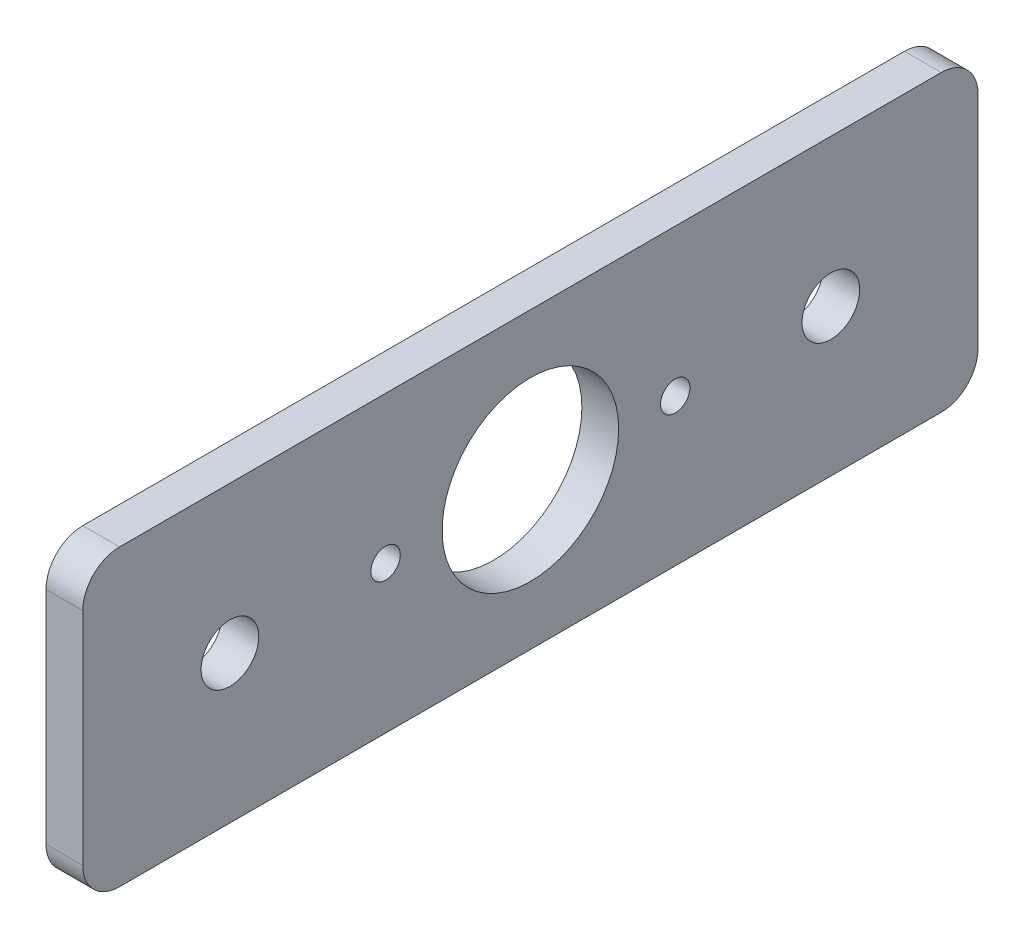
from build123d import *

# Parameters (mm, degrees)
SKETCH1_W           = 77.2668
SKETCH1_H           = 25.4
SKETCH1_R           = 7.62
SKETCH1_R_2         = 1.27
SKETCH1_R_3         = 2.4892
BOSS_EXTRUDE1_DEPTH = 3.175
FILLET1_R           = 3.175


with BuildPart() as part:
    # Sketch1 → Boss-Extrude1 (new body)
    with BuildSketch(Plane(origin=(0, 0, 0), x_dir=(0, 0, -1), z_dir=(1, 0, 0))):
        with Locations((38.6334, 12.7)):
            Rectangle(SKETCH1_W, SKETCH1_H)
        with Locations((38.6334, 12.7)):
            Circle(SKETCH1_R, mode=Mode.SUBTRACT)
        with Locations((51.1334, 12.7)):
            Circle(SKETCH1_R_2, mode=Mode.SUBTRACT)
        with Locations((26.1334, 12.7)):
            Circle(SKETCH1_R_2, mode=Mode.SUBTRACT)
        with Locations((64.5668, 12.7)):
            Circle(SKETCH1_R_3, mode=Mode.SUBTRACT)
        with Locations((12.7, 12.7)):
            Circle(SKETCH1_R_3, mode=Mode.SUBTRACT)
    extrude(amount=BOSS_EXTRUDE1_DEPTH)

    # Fillet1
    fillet1_edges = [part.edges().sort_by_distance(p)[0] for p in [
        (1.5875, 25.4, 0),
        (1.5875, 25.4, -77.2668),
        (1.5875, 0, -77.2668),
        (1.5875, 0, 0),
    ]]
    fillet(fillet1_edges, radius=FILLET1_R)


solid = part.part
